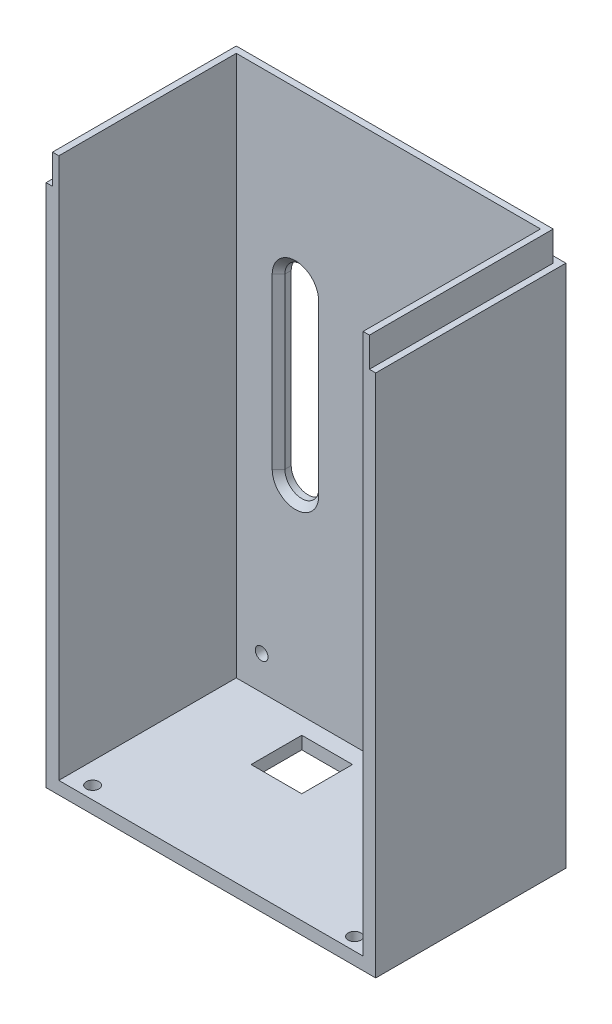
ISO-10303-21;
HEADER;
FILE_DESCRIPTION(('STEP AP214'),'2;1');
FILE_NAME('part.step','',(''),(''),'','','');
FILE_SCHEMA(('AUTOMOTIVE_DESIGN { 1 0 10303 214 1 1 1 1 }'));
ENDSEC;
DATA;
#1=APPLICATION_CONTEXT('core data for automotive mechanical design processes');
#2=APPLICATION_PROTOCOL_DEFINITION('international standard','automotive_design',2000,#1);
#3=PRODUCT_CONTEXT('',#1,'mechanical');
#4=PRODUCT('Part','Part','',(#3));
#5=PRODUCT_RELATED_PRODUCT_CATEGORY('part','',(#4));
#6=PRODUCT_DEFINITION_FORMATION('','',#4);
#7=PRODUCT_DEFINITION_CONTEXT('part definition',#1,'design');
#8=PRODUCT_DEFINITION('design','',#6,#7);
#9=PRODUCT_DEFINITION_SHAPE('','',#8);
#10=(LENGTH_UNIT() NAMED_UNIT(*) SI_UNIT(.MILLI.,.METRE.));
#11=(NAMED_UNIT(*) PLANE_ANGLE_UNIT() SI_UNIT($,.RADIAN.));
#12=(NAMED_UNIT(*) SI_UNIT($,.STERADIAN.) SOLID_ANGLE_UNIT());
#13=UNCERTAINTY_MEASURE_WITH_UNIT(LENGTH_MEASURE(1.E-05),#10,'distance_accuracy_value','');
#14=(GEOMETRIC_REPRESENTATION_CONTEXT(3) GLOBAL_UNCERTAINTY_ASSIGNED_CONTEXT((#13)) GLOBAL_UNIT_ASSIGNED_CONTEXT((#10,
#11,#12)) REPRESENTATION_CONTEXT('',''));
#15=CARTESIAN_POINT('',(0.,0.,0.));
#16=DIRECTION('',(0.,0.,1.));
#17=DIRECTION('',(1.,0.,0.));
#18=AXIS2_PLACEMENT_3D('',#15,#16,#17);
#19=CARTESIAN_POINT('',(39.,128.,3.));
#20=DIRECTION('',(-1.,0.,0.));
#21=DIRECTION('',(0.,-1.,0.));
#22=AXIS2_PLACEMENT_3D('',#19,#20,#21);
#23=PLANE('',#22);
#24=DIRECTION('',(0.,1.,0.));
#25=VECTOR('',#24,1.);
#26=CARTESIAN_POINT('',(39.,128.,0.));
#27=LINE('',#26,#25);
#28=CARTESIAN_POINT('',(39.,-128.,0.));
#29=VERTEX_POINT('',#28);
#30=CARTESIAN_POINT('',(39.,-4.00000000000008,0.));
#31=VERTEX_POINT('',#30);
#32=EDGE_CURVE('E428',#29,#31,#27,.T.);
#33=ORIENTED_EDGE('',*,*,#32,.T.);
#34=DIRECTION('',(0.,0.,-1.));
#35=VECTOR('',#34,1.);
#36=CARTESIAN_POINT('',(39.,-4.00000000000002,45.));
#37=LINE('',#36,#35);
#38=CARTESIAN_POINT('',(39.,-4.00000000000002,45.));
#39=VERTEX_POINT('',#38);
#40=EDGE_CURVE('E299',#39,#31,#37,.T.);
#41=ORIENTED_EDGE('',*,*,#40,.F.);
#42=DIRECTION('',(0.,1.,0.));
#43=VECTOR('',#42,1.);
#44=CARTESIAN_POINT('',(39.,-128.,45.));
#45=LINE('',#44,#43);
#46=CARTESIAN_POINT('',(39.,-128.,45.));
#47=VERTEX_POINT('',#46);
#48=EDGE_CURVE('E425',#47,#39,#45,.T.);
#49=ORIENTED_EDGE('',*,*,#48,.F.);
#50=DIRECTION('',(0.,0.,-1.));
#51=VECTOR('',#50,1.);
#52=CARTESIAN_POINT('',(39.,-128.,3.));
#53=LINE('',#52,#51);
#54=EDGE_CURVE('E435',#47,#29,#53,.T.);
#55=ORIENTED_EDGE('',*,*,#54,.T.);
#56=EDGE_LOOP('',(#33,#41,#49,#55));
#57=FACE_BOUND('',#56,.T.);
#58=ADVANCED_FACE('F41',(#57),#23,.F.);
#59=CARTESIAN_POINT('',(-39.,128.,3.));
#60=DIRECTION('',(1.,0.,0.));
#61=DIRECTION('',(0.,1.,0.));
#62=AXIS2_PLACEMENT_3D('',#59,#60,#61);
#63=PLANE('',#62);
#64=DIRECTION('',(0.,0.,-1.));
#65=VECTOR('',#64,1.);
#66=CARTESIAN_POINT('',(-39.,-4.00000000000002,45.));
#67=LINE('',#66,#65);
#68=CARTESIAN_POINT('',(-39.,-4.00000000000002,45.));
#69=VERTEX_POINT('',#68);
#70=CARTESIAN_POINT('',(-39.,-3.99999999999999,0.));
#71=VERTEX_POINT('',#70);
#72=EDGE_CURVE('E264',#69,#71,#67,.T.);
#73=ORIENTED_EDGE('',*,*,#72,.T.);
#74=DIRECTION('',(0.,-1.,0.));
#75=VECTOR('',#74,1.);
#76=CARTESIAN_POINT('',(-39.,128.,0.));
#77=LINE('',#76,#75);
#78=CARTESIAN_POINT('',(-39.,-128.,0.));
#79=VERTEX_POINT('',#78);
#80=EDGE_CURVE('E431',#71,#79,#77,.T.);
#81=ORIENTED_EDGE('',*,*,#80,.T.);
#82=DIRECTION('',(0.,0.,-1.));
#83=VECTOR('',#82,1.);
#84=CARTESIAN_POINT('',(-39.,-128.,3.));
#85=LINE('',#84,#83);
#86=CARTESIAN_POINT('',(-39.,-128.,45.));
#87=VERTEX_POINT('',#86);
#88=EDGE_CURVE('E438',#87,#79,#85,.T.);
#89=ORIENTED_EDGE('',*,*,#88,.F.);
#90=DIRECTION('',(0.,-1.,0.));
#91=VECTOR('',#90,1.);
#92=CARTESIAN_POINT('',(-39.,128.,45.));
#93=LINE('',#92,#91);
#94=EDGE_CURVE('E420',#69,#87,#93,.T.);
#95=ORIENTED_EDGE('',*,*,#94,.F.);
#96=EDGE_LOOP('',(#73,#81,#89,#95));
#97=FACE_BOUND('',#96,.T.);
#98=ADVANCED_FACE('F568',(#97),#63,.F.);
#99=CARTESIAN_POINT('',(0.,0.,0.));
#100=DIRECTION('',(0.,0.,1.));
#101=DIRECTION('',(1.,0.,0.));
#102=AXIS2_PLACEMENT_3D('',#99,#100,#101);
#103=PLANE('',#102);
#104=CARTESIAN_POINT('',(22.,-78.,0.));
#105=DIRECTION('',(0.,0.,1.));
#106=DIRECTION('',(1.,0.,0.));
#107=AXIS2_PLACEMENT_3D('',#104,#105,#106);
#108=CIRCLE('',#107,5.5);
#109=CARTESIAN_POINT('',(16.5,-78.,0.));
#110=VERTEX_POINT('',#109);
#111=CARTESIAN_POINT('',(27.5,-78.,0.));
#112=VERTEX_POINT('',#111);
#113=EDGE_CURVE('E510',#110,#112,#108,.T.);
#114=ORIENTED_EDGE('',*,*,#113,.T.);
#115=DIRECTION('',(0.,1.,0.));
#116=VECTOR('',#115,1.);
#117=CARTESIAN_POINT('',(27.5,0.,0.));
#118=LINE('',#117,#116);
#119=CARTESIAN_POINT('',(27.5,-38.,0.));
#120=VERTEX_POINT('',#119);
#121=EDGE_CURVE('E512',#112,#120,#118,.T.);
#122=ORIENTED_EDGE('',*,*,#121,.T.);
#123=CARTESIAN_POINT('',(22.,-38.,0.));
#124=DIRECTION('',(0.,0.,1.));
#125=DIRECTION('',(1.,0.,0.));
#126=AXIS2_PLACEMENT_3D('',#123,#124,#125);
#127=CIRCLE('',#126,5.5);
#128=CARTESIAN_POINT('',(16.5,-38.,0.));
#129=VERTEX_POINT('',#128);
#130=EDGE_CURVE('E508',#120,#129,#127,.T.);
#131=ORIENTED_EDGE('',*,*,#130,.T.);
#132=DIRECTION('',(0.,-1.,0.));
#133=VECTOR('',#132,1.);
#134=CARTESIAN_POINT('',(16.5,0.,0.));
#135=LINE('',#134,#133);
#136=EDGE_CURVE('E506',#129,#110,#135,.T.);
#137=ORIENTED_EDGE('',*,*,#136,.T.);
#138=EDGE_LOOP('',(#114,#122,#131,#137));
#139=FACE_BOUND('',#138,.T.);
#140=DIRECTION('',(0.,-1.,0.));
#141=VECTOR('',#140,1.);
#142=CARTESIAN_POINT('',(-18.0000000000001,-38.,0.));
#143=LINE('',#142,#141);
#144=CARTESIAN_POINT('',(-18.0000000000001,-38.,0.));
#145=VERTEX_POINT('',#144);
#146=CARTESIAN_POINT('',(-18.0000000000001,-78.,0.));
#147=VERTEX_POINT('',#146);
#148=EDGE_CURVE('E345',#145,#147,#143,.T.);
#149=ORIENTED_EDGE('',*,*,#148,.F.);
#150=CARTESIAN_POINT('',(-22.0000000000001,-38.,0.));
#151=DIRECTION('',(0.,0.,-1.));
#152=DIRECTION('',(-1.,0.,0.));
#153=AXIS2_PLACEMENT_3D('',#150,#151,#152);
#154=CIRCLE('',#153,4.);
#155=CARTESIAN_POINT('',(-26.0000000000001,-38.,0.));
#156=VERTEX_POINT('',#155);
#157=EDGE_CURVE('E348',#156,#145,#154,.T.);
#158=ORIENTED_EDGE('',*,*,#157,.F.);
#159=DIRECTION('',(0.,1.,0.));
#160=VECTOR('',#159,1.);
#161=CARTESIAN_POINT('',(-26.0000000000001,-38.,0.));
#162=LINE('',#161,#160);
#163=CARTESIAN_POINT('',(-26.0000000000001,-78.,0.));
#164=VERTEX_POINT('',#163);
#165=EDGE_CURVE('E334',#164,#156,#162,.T.);
#166=ORIENTED_EDGE('',*,*,#165,.F.);
#167=CARTESIAN_POINT('',(-22.0000000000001,-78.,0.));
#168=DIRECTION('',(0.,0.,-1.));
#169=DIRECTION('',(-1.,0.,0.));
#170=AXIS2_PLACEMENT_3D('',#167,#168,#169);
#171=CIRCLE('',#170,4.);
#172=EDGE_CURVE('E342',#147,#164,#171,.T.);
#173=ORIENTED_EDGE('',*,*,#172,.F.);
#174=EDGE_LOOP('',(#149,#158,#166,#173));
#175=FACE_BOUND('',#174,.T.);
#176=CARTESIAN_POINT('',(-30.,-117.,0.));
#177=DIRECTION('',(0.,0.,-1.));
#178=DIRECTION('',(-1.,0.,0.));
#179=AXIS2_PLACEMENT_3D('',#176,#177,#178);
#180=CIRCLE('',#179,1.5);
#181=CARTESIAN_POINT('',(-31.5,-117.,0.));
#182=VERTEX_POINT('',#181);
#183=EDGE_CURVE('E315',#182,#182,#180,.T.);
#184=ORIENTED_EDGE('',*,*,#183,.F.);
#185=EDGE_LOOP('',(#184));
#186=FACE_BOUND('',#185,.T.);
#187=CARTESIAN_POINT('',(30.,-117.,0.));
#188=DIRECTION('',(0.,0.,-1.));
#189=DIRECTION('',(-1.,0.,0.));
#190=AXIS2_PLACEMENT_3D('',#187,#188,#189);
#191=CIRCLE('',#190,1.5);
#192=CARTESIAN_POINT('',(28.5,-117.,0.));
#193=VERTEX_POINT('',#192);
#194=EDGE_CURVE('E314',#193,#193,#191,.T.);
#195=ORIENTED_EDGE('',*,*,#194,.F.);
#196=EDGE_LOOP('',(#195));
#197=FACE_BOUND('',#196,.T.);
#198=DIRECTION('',(-1.,0.,0.));
#199=VECTOR('',#198,1.);
#200=CARTESIAN_POINT('',(39.,-4.00000000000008,0.));
#201=LINE('',#200,#199);
#202=EDGE_CURVE('E275',#31,#71,#201,.T.);
#203=ORIENTED_EDGE('',*,*,#202,.F.);
#204=ORIENTED_EDGE('',*,*,#32,.F.);
#205=DIRECTION('',(1.,0.,0.));
#206=VECTOR('',#205,1.);
#207=CARTESIAN_POINT('',(-39.,-128.,0.));
#208=LINE('',#207,#206);
#209=EDGE_CURVE('E433',#79,#29,#208,.T.);
#210=ORIENTED_EDGE('',*,*,#209,.F.);
#211=ORIENTED_EDGE('',*,*,#80,.F.);
#212=EDGE_LOOP('',(#203,#204,#210,#211));
#213=FACE_BOUND('',#212,.T.);
#214=ADVANCED_FACE('F535',(#139,#175,#186,#197,#213),#103,.F.);
#215=CARTESIAN_POINT('',(0.,0.,45.));
#216=DIRECTION('',(0.,0.,1.));
#217=DIRECTION('',(1.,0.,0.));
#218=AXIS2_PLACEMENT_3D('',#215,#216,#217);
#219=PLANE('',#218);
#220=DIRECTION('',(0.,1.,0.));
#221=VECTOR('',#220,1.);
#222=CARTESIAN_POINT('',(-37.5,2.99999999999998,45.));
#223=LINE('',#222,#221);
#224=CARTESIAN_POINT('',(-37.5,-4.00000000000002,45.));
#225=VERTEX_POINT('',#224);
#226=CARTESIAN_POINT('',(-37.5,2.99999999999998,45.));
#227=VERTEX_POINT('',#226);
#228=EDGE_CURVE('E290',#225,#227,#223,.T.);
#229=ORIENTED_EDGE('',*,*,#228,.F.);
#230=DIRECTION('',(1.,0.,0.));
#231=VECTOR('',#230,1.);
#232=CARTESIAN_POINT('',(-37.5,-4.00000000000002,45.));
#233=LINE('',#232,#231);
#234=EDGE_CURVE('E261',#69,#225,#233,.T.);
#235=ORIENTED_EDGE('',*,*,#234,.F.);
#236=ORIENTED_EDGE('',*,*,#94,.T.);
#237=DIRECTION('',(1.,0.,0.));
#238=VECTOR('',#237,1.);
#239=CARTESIAN_POINT('',(-39.,-128.,45.));
#240=LINE('',#239,#238);
#241=EDGE_CURVE('E422',#87,#47,#240,.T.);
#242=ORIENTED_EDGE('',*,*,#241,.T.);
#243=ORIENTED_EDGE('',*,*,#48,.T.);
#244=DIRECTION('',(1.,0.,0.));
#245=VECTOR('',#244,1.);
#246=CARTESIAN_POINT('',(37.5,-4.00000000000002,45.));
#247=LINE('',#246,#245);
#248=CARTESIAN_POINT('',(37.5,-4.00000000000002,45.));
#249=VERTEX_POINT('',#248);
#250=EDGE_CURVE('E301',#249,#39,#247,.T.);
#251=ORIENTED_EDGE('',*,*,#250,.F.);
#252=DIRECTION('',(0.,-1.,0.));
#253=VECTOR('',#252,1.);
#254=CARTESIAN_POINT('',(37.5,2.99999999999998,45.));
#255=LINE('',#254,#253);
#256=CARTESIAN_POINT('',(37.5,2.99999999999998,45.));
#257=VERTEX_POINT('',#256);
#258=EDGE_CURVE('E291',#257,#249,#255,.T.);
#259=ORIENTED_EDGE('',*,*,#258,.F.);
#260=DIRECTION('',(1.,0.,0.));
#261=VECTOR('',#260,1.);
#262=CARTESIAN_POINT('',(36.,2.99999999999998,45.));
#263=LINE('',#262,#261);
#264=CARTESIAN_POINT('',(36.,2.99999999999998,45.));
#265=VERTEX_POINT('',#264);
#266=EDGE_CURVE('E305',#265,#257,#263,.T.);
#267=ORIENTED_EDGE('',*,*,#266,.F.);
#268=DIRECTION('',(0.,1.,0.));
#269=VECTOR('',#268,1.);
#270=CARTESIAN_POINT('',(36.,-125.,45.));
#271=LINE('',#270,#269);
#272=CARTESIAN_POINT('',(36.,-125.,45.));
#273=VERTEX_POINT('',#272);
#274=EDGE_CURVE('E406',#273,#265,#271,.T.);
#275=ORIENTED_EDGE('',*,*,#274,.F.);
#276=DIRECTION('',(1.,0.,0.));
#277=VECTOR('',#276,1.);
#278=CARTESIAN_POINT('',(-36.,-125.,45.));
#279=LINE('',#278,#277);
#280=CARTESIAN_POINT('',(-36.,-125.,45.));
#281=VERTEX_POINT('',#280);
#282=EDGE_CURVE('E402',#281,#273,#279,.T.);
#283=ORIENTED_EDGE('',*,*,#282,.F.);
#284=DIRECTION('',(0.,-1.,0.));
#285=VECTOR('',#284,1.);
#286=CARTESIAN_POINT('',(-36.,125.,45.));
#287=LINE('',#286,#285);
#288=CARTESIAN_POINT('',(-36.,2.99999999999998,45.));
#289=VERTEX_POINT('',#288);
#290=EDGE_CURVE('E400',#289,#281,#287,.T.);
#291=ORIENTED_EDGE('',*,*,#290,.F.);
#292=EDGE_CURVE('E306',#227,#289,#263,.T.);
#293=ORIENTED_EDGE('',*,*,#292,.F.);
#294=EDGE_LOOP('',(#229,#235,#236,#242,#243,#251,#259,#267,#275,#283,#291,#293));
#295=FACE_BOUND('',#294,.T.);
#296=ADVANCED_FACE('F750',(#295),#219,.T.);
#297=CARTESIAN_POINT('',(39.,2.99999999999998,45.));
#298=DIRECTION('',(0.,1.,0.));
#299=DIRECTION('',(-1.,0.,0.));
#300=AXIS2_PLACEMENT_3D('',#297,#298,#299);
#301=PLANE('',#300);
#302=DIRECTION('',(0.,0.,-1.));
#303=VECTOR('',#302,1.);
#304=CARTESIAN_POINT('',(37.5,2.99999999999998,45.));
#305=LINE('',#304,#303);
#306=CARTESIAN_POINT('',(37.5,2.99999999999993,1.5));
#307=VERTEX_POINT('',#306);
#308=EDGE_CURVE('E287',#257,#307,#305,.T.);
#309=ORIENTED_EDGE('',*,*,#308,.T.);
#310=DIRECTION('',(1.,0.,0.));
#311=VECTOR('',#310,1.);
#312=CARTESIAN_POINT('',(-37.5,3.00000000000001,1.5));
#313=LINE('',#312,#311);
#314=CARTESIAN_POINT('',(-37.5,3.00000000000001,1.5));
#315=VERTEX_POINT('',#314);
#316=EDGE_CURVE('E280',#315,#307,#313,.T.);
#317=ORIENTED_EDGE('',*,*,#316,.F.);
#318=DIRECTION('',(0.,0.,-1.));
#319=VECTOR('',#318,1.);
#320=CARTESIAN_POINT('',(-37.5,2.99999999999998,45.));
#321=LINE('',#320,#319);
#322=EDGE_CURVE('E265',#227,#315,#321,.T.);
#323=ORIENTED_EDGE('',*,*,#322,.F.);
#324=ORIENTED_EDGE('',*,*,#292,.T.);
#325=DIRECTION('',(0.,0.,1.));
#326=VECTOR('',#325,1.);
#327=CARTESIAN_POINT('',(-36.,2.99999999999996,45.));
#328=LINE('',#327,#326);
#329=CARTESIAN_POINT('',(-36.,2.99999999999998,3.));
#330=VERTEX_POINT('',#329);
#331=EDGE_CURVE('E311',#330,#289,#328,.T.);
#332=ORIENTED_EDGE('',*,*,#331,.F.);
#333=DIRECTION('',(1.,0.,0.));
#334=VECTOR('',#333,1.);
#335=CARTESIAN_POINT('',(39.,2.99999999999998,3.));
#336=LINE('',#335,#334);
#337=CARTESIAN_POINT('',(36.,2.99999999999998,3.));
#338=VERTEX_POINT('',#337);
#339=EDGE_CURVE('E295',#330,#338,#336,.T.);
#340=ORIENTED_EDGE('',*,*,#339,.T.);
#341=DIRECTION('',(0.,0.,-1.));
#342=VECTOR('',#341,1.);
#343=CARTESIAN_POINT('',(36.,2.99999999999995,45.));
#344=LINE('',#343,#342);
#345=EDGE_CURVE('E308',#265,#338,#344,.T.);
#346=ORIENTED_EDGE('',*,*,#345,.F.);
#347=ORIENTED_EDGE('',*,*,#266,.T.);
#348=EDGE_LOOP('',(#309,#317,#323,#324,#332,#340,#346,#347));
#349=FACE_BOUND('',#348,.T.);
#350=ADVANCED_FACE('F763',(#349),#301,.T.);
#351=CARTESIAN_POINT('',(-36.,125.,45.));
#352=DIRECTION('',(1.,0.,0.));
#353=DIRECTION('',(0.,1.,0.));
#354=AXIS2_PLACEMENT_3D('',#351,#352,#353);
#355=PLANE('',#354);
#356=DIRECTION('',(0.,-1.,0.));
#357=VECTOR('',#356,1.);
#358=CARTESIAN_POINT('',(-36.,125.,3.));
#359=LINE('',#358,#357);
#360=CARTESIAN_POINT('',(-36.,-125.,3.));
#361=VERTEX_POINT('',#360);
#362=EDGE_CURVE('E373',#330,#361,#359,.T.);
#363=ORIENTED_EDGE('',*,*,#362,.F.);
#364=ORIENTED_EDGE('',*,*,#331,.T.);
#365=ORIENTED_EDGE('',*,*,#290,.T.);
#366=DIRECTION('',(0.,0.,-1.));
#367=VECTOR('',#366,1.);
#368=CARTESIAN_POINT('',(-36.,-125.,45.));
#369=LINE('',#368,#367);
#370=EDGE_CURVE('E417',#281,#361,#369,.T.);
#371=ORIENTED_EDGE('',*,*,#370,.T.);
#372=EDGE_LOOP('',(#363,#364,#365,#371));
#373=FACE_BOUND('',#372,.T.);
#374=ADVANCED_FACE('F771',(#373),#355,.T.);
#375=CARTESIAN_POINT('',(36.,-125.,45.));
#376=DIRECTION('',(-1.,0.,0.));
#377=DIRECTION('',(0.,-1.,0.));
#378=AXIS2_PLACEMENT_3D('',#375,#376,#377);
#379=PLANE('',#378);
#380=ORIENTED_EDGE('',*,*,#274,.T.);
#381=ORIENTED_EDGE('',*,*,#345,.T.);
#382=DIRECTION('',(0.,1.,0.));
#383=VECTOR('',#382,1.);
#384=CARTESIAN_POINT('',(36.,-125.,3.));
#385=LINE('',#384,#383);
#386=CARTESIAN_POINT('',(36.,-125.,3.));
#387=VERTEX_POINT('',#386);
#388=EDGE_CURVE('E403',#387,#338,#385,.T.);
#389=ORIENTED_EDGE('',*,*,#388,.F.);
#390=DIRECTION('',(0.,0.,-1.));
#391=VECTOR('',#390,1.);
#392=CARTESIAN_POINT('',(36.,-125.,45.));
#393=LINE('',#392,#391);
#394=EDGE_CURVE('E409',#273,#387,#393,.T.);
#395=ORIENTED_EDGE('',*,*,#394,.F.);
#396=EDGE_LOOP('',(#380,#381,#389,#395));
#397=FACE_BOUND('',#396,.T.);
#398=ADVANCED_FACE('F778',(#397),#379,.T.);
#399=CARTESIAN_POINT('',(-39.,-128.,3.));
#400=DIRECTION('',(0.,1.,0.));
#401=DIRECTION('',(0.,0.,1.));
#402=AXIS2_PLACEMENT_3D('',#399,#400,#401);
#403=PLANE('',#402);
#404=CARTESIAN_POINT('',(-31.,-128.,42.));
#405=DIRECTION('',(0.,-1.,0.));
#406=DIRECTION('',(0.,0.,-1.));
#407=AXIS2_PLACEMENT_3D('',#404,#405,#406);
#408=CIRCLE('',#407,1.5);
#409=CARTESIAN_POINT('',(-31.,-128.,40.5));
#410=VERTEX_POINT('',#409);
#411=EDGE_CURVE('E352',#410,#410,#408,.T.);
#412=ORIENTED_EDGE('',*,*,#411,.F.);
#413=EDGE_LOOP('',(#412));
#414=FACE_BOUND('',#413,.T.);
#415=CARTESIAN_POINT('',(31.,-128.,42.));
#416=DIRECTION('',(0.,-1.,0.));
#417=DIRECTION('',(0.,0.,-1.));
#418=AXIS2_PLACEMENT_3D('',#415,#416,#417);
#419=CIRCLE('',#418,1.5);
#420=CARTESIAN_POINT('',(31.,-128.,40.5));
#421=VERTEX_POINT('',#420);
#422=EDGE_CURVE('E351',#421,#421,#419,.T.);
#423=ORIENTED_EDGE('',*,*,#422,.F.);
#424=EDGE_LOOP('',(#423));
#425=FACE_BOUND('',#424,.T.);
#426=DIRECTION('',(-1.,0.,0.));
#427=VECTOR('',#426,1.);
#428=CARTESIAN_POINT('',(-16.5,-128.,19.));
#429=LINE('',#428,#427);
#430=CARTESIAN_POINT('',(-4.50000000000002,-128.,19.));
#431=VERTEX_POINT('',#430);
#432=CARTESIAN_POINT('',(-16.5,-128.,19.));
#433=VERTEX_POINT('',#432);
#434=EDGE_CURVE('E360',#431,#433,#429,.T.);
#435=ORIENTED_EDGE('',*,*,#434,.F.);
#436=DIRECTION('',(0.,0.,1.));
#437=VECTOR('',#436,1.);
#438=CARTESIAN_POINT('',(-4.50000000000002,-128.,19.));
#439=LINE('',#438,#437);
#440=CARTESIAN_POINT('',(-4.50000000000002,-128.,7.00000000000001));
#441=VERTEX_POINT('',#440);
#442=EDGE_CURVE('E358',#441,#431,#439,.T.);
#443=ORIENTED_EDGE('',*,*,#442,.F.);
#444=DIRECTION('',(1.,0.,0.));
#445=VECTOR('',#444,1.);
#446=CARTESIAN_POINT('',(-16.5,-128.,7.00000000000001));
#447=LINE('',#446,#445);
#448=CARTESIAN_POINT('',(-16.5,-128.,7.00000000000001));
#449=VERTEX_POINT('',#448);
#450=EDGE_CURVE('E367',#449,#441,#447,.T.);
#451=ORIENTED_EDGE('',*,*,#450,.F.);
#452=DIRECTION('',(0.,0.,-1.));
#453=VECTOR('',#452,1.);
#454=CARTESIAN_POINT('',(-16.5,-128.,7.00000000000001));
#455=LINE('',#454,#453);
#456=EDGE_CURVE('E364',#433,#449,#455,.T.);
#457=ORIENTED_EDGE('',*,*,#456,.F.);
#458=EDGE_LOOP('',(#435,#443,#451,#457));
#459=FACE_BOUND('',#458,.T.);
#460=DIRECTION('',(0.,0.,1.));
#461=VECTOR('',#460,1.);
#462=CARTESIAN_POINT('',(24.,-128.,7.00000000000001));
#463=LINE('',#462,#461);
#464=CARTESIAN_POINT('',(24.,-128.,7.00000000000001));
#465=VERTEX_POINT('',#464);
#466=CARTESIAN_POINT('',(24.,-128.,18.));
#467=VERTEX_POINT('',#466);
#468=EDGE_CURVE('E396',#465,#467,#463,.T.);
#469=ORIENTED_EDGE('',*,*,#468,.F.);
#470=DIRECTION('',(1.,0.,0.));
#471=VECTOR('',#470,1.);
#472=CARTESIAN_POINT('',(14.5,-128.,7.00000000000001));
#473=LINE('',#472,#471);
#474=CARTESIAN_POINT('',(14.5,-128.,7.00000000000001));
#475=VERTEX_POINT('',#474);
#476=EDGE_CURVE('E361',#475,#465,#473,.T.);
#477=ORIENTED_EDGE('',*,*,#476,.F.);
#478=DIRECTION('',(0.,0.,-1.));
#479=VECTOR('',#478,1.);
#480=CARTESIAN_POINT('',(14.5,-128.,18.));
#481=LINE('',#480,#479);
#482=CARTESIAN_POINT('',(14.5,-128.,18.));
#483=VERTEX_POINT('',#482);
#484=EDGE_CURVE('E383',#483,#475,#481,.T.);
#485=ORIENTED_EDGE('',*,*,#484,.F.);
#486=DIRECTION('',(-1.,0.,0.));
#487=VECTOR('',#486,1.);
#488=CARTESIAN_POINT('',(24.,-128.,18.));
#489=LINE('',#488,#487);
#490=EDGE_CURVE('E393',#467,#483,#489,.T.);
#491=ORIENTED_EDGE('',*,*,#490,.F.);
#492=EDGE_LOOP('',(#469,#477,#485,#491));
#493=FACE_BOUND('',#492,.T.);
#494=ORIENTED_EDGE('',*,*,#209,.T.);
#495=ORIENTED_EDGE('',*,*,#54,.F.);
#496=ORIENTED_EDGE('',*,*,#241,.F.);
#497=ORIENTED_EDGE('',*,*,#88,.T.);
#498=EDGE_LOOP('',(#494,#495,#496,#497));
#499=FACE_BOUND('',#498,.T.);
#500=ADVANCED_FACE('F785',(#414,#425,#459,#493,#499),#403,.F.);
#501=CARTESIAN_POINT('',(-36.,-125.,45.));
#502=DIRECTION('',(0.,1.,0.));
#503=DIRECTION('',(0.,0.,1.));
#504=AXIS2_PLACEMENT_3D('',#501,#502,#503);
#505=PLANE('',#504);
#506=CARTESIAN_POINT('',(-31.,-125.,42.));
#507=DIRECTION('',(0.,1.,0.));
#508=DIRECTION('',(0.,0.,1.));
#509=AXIS2_PLACEMENT_3D('',#506,#507,#508);
#510=CIRCLE('',#509,1.5);
#511=CARTESIAN_POINT('',(-31.,-125.,43.5));
#512=VERTEX_POINT('',#511);
#513=EDGE_CURVE('E390',#512,#512,#510,.T.);
#514=ORIENTED_EDGE('',*,*,#513,.F.);
#515=EDGE_LOOP('',(#514));
#516=FACE_BOUND('',#515,.T.);
#517=CARTESIAN_POINT('',(31.,-125.,42.));
#518=DIRECTION('',(0.,1.,0.));
#519=DIRECTION('',(0.,0.,1.));
#520=AXIS2_PLACEMENT_3D('',#517,#518,#519);
#521=CIRCLE('',#520,1.5);
#522=CARTESIAN_POINT('',(31.,-125.,43.5));
#523=VERTEX_POINT('',#522);
#524=EDGE_CURVE('E355',#523,#523,#521,.T.);
#525=ORIENTED_EDGE('',*,*,#524,.F.);
#526=EDGE_LOOP('',(#525));
#527=FACE_BOUND('',#526,.T.);
#528=DIRECTION('',(0.,0.,-1.));
#529=VECTOR('',#528,1.);
#530=CARTESIAN_POINT('',(-4.50000000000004,-125.,45.));
#531=LINE('',#530,#529);
#532=CARTESIAN_POINT('',(-4.50000000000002,-125.,19.));
#533=VERTEX_POINT('',#532);
#534=CARTESIAN_POINT('',(-4.50000000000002,-125.,7.00000000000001));
#535=VERTEX_POINT('',#534);
#536=EDGE_CURVE('E457',#533,#535,#531,.T.);
#537=ORIENTED_EDGE('',*,*,#536,.F.);
#538=DIRECTION('',(1.,0.,0.));
#539=VECTOR('',#538,1.);
#540=CARTESIAN_POINT('',(-36.,-125.,19.));
#541=LINE('',#540,#539);
#542=CARTESIAN_POINT('',(-16.5,-125.,19.));
#543=VERTEX_POINT('',#542);
#544=EDGE_CURVE('E450',#543,#533,#541,.T.);
#545=ORIENTED_EDGE('',*,*,#544,.F.);
#546=DIRECTION('',(0.,0.,1.));
#547=VECTOR('',#546,1.);
#548=CARTESIAN_POINT('',(-16.5,-125.,45.));
#549=LINE('',#548,#547);
#550=CARTESIAN_POINT('',(-16.5,-125.,7.00000000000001));
#551=VERTEX_POINT('',#550);
#552=EDGE_CURVE('E452',#551,#543,#549,.T.);
#553=ORIENTED_EDGE('',*,*,#552,.F.);
#554=DIRECTION('',(-1.,0.,0.));
#555=VECTOR('',#554,1.);
#556=CARTESIAN_POINT('',(-36.,-125.,7.00000000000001));
#557=LINE('',#556,#555);
#558=EDGE_CURVE('E455',#535,#551,#557,.T.);
#559=ORIENTED_EDGE('',*,*,#558,.F.);
#560=EDGE_LOOP('',(#537,#545,#553,#559));
#561=FACE_BOUND('',#560,.T.);
#562=DIRECTION('',(-1.,0.,0.));
#563=VECTOR('',#562,1.);
#564=CARTESIAN_POINT('',(-36.,-125.,6.99999999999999));
#565=LINE('',#564,#563);
#566=CARTESIAN_POINT('',(24.,-125.,7.00000000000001));
#567=VERTEX_POINT('',#566);
#568=CARTESIAN_POINT('',(14.5,-125.,7.00000000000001));
#569=VERTEX_POINT('',#568);
#570=EDGE_CURVE('E448',#567,#569,#565,.T.);
#571=ORIENTED_EDGE('',*,*,#570,.F.);
#572=DIRECTION('',(0.,0.,-1.));
#573=VECTOR('',#572,1.);
#574=CARTESIAN_POINT('',(24.,-125.,45.));
#575=LINE('',#574,#573);
#576=CARTESIAN_POINT('',(24.,-125.,18.));
#577=VERTEX_POINT('',#576);
#578=EDGE_CURVE('E441',#577,#567,#575,.T.);
#579=ORIENTED_EDGE('',*,*,#578,.F.);
#580=DIRECTION('',(1.,0.,0.));
#581=VECTOR('',#580,1.);
#582=CARTESIAN_POINT('',(-36.,-125.,18.));
#583=LINE('',#582,#581);
#584=CARTESIAN_POINT('',(14.5,-125.,18.));
#585=VERTEX_POINT('',#584);
#586=EDGE_CURVE('E443',#585,#577,#583,.T.);
#587=ORIENTED_EDGE('',*,*,#586,.F.);
#588=DIRECTION('',(0.,0.,1.));
#589=VECTOR('',#588,1.);
#590=CARTESIAN_POINT('',(14.5,-125.,45.));
#591=LINE('',#590,#589);
#592=EDGE_CURVE('E446',#569,#585,#591,.T.);
#593=ORIENTED_EDGE('',*,*,#592,.F.);
#594=EDGE_LOOP('',(#571,#579,#587,#593));
#595=FACE_BOUND('',#594,.T.);
#596=DIRECTION('',(1.,0.,0.));
#597=VECTOR('',#596,1.);
#598=CARTESIAN_POINT('',(-36.,-125.,3.));
#599=LINE('',#598,#597);
#600=EDGE_CURVE('E411',#361,#387,#599,.T.);
#601=ORIENTED_EDGE('',*,*,#600,.F.);
#602=ORIENTED_EDGE('',*,*,#370,.F.);
#603=ORIENTED_EDGE('',*,*,#282,.T.);
#604=ORIENTED_EDGE('',*,*,#394,.T.);
#605=EDGE_LOOP('',(#601,#602,#603,#604));
#606=FACE_BOUND('',#605,.T.);
#607=ADVANCED_FACE('F793',(#516,#527,#561,#595,#606),#505,.T.);
#608=CARTESIAN_POINT('',(0.,0.,3.));
#609=DIRECTION('',(0.,0.,1.));
#610=DIRECTION('',(1.,0.,0.));
#611=AXIS2_PLACEMENT_3D('',#608,#609,#610);
#612=PLANE('',#611);
#613=CARTESIAN_POINT('',(-22.0000000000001,-78.,3.));
#614=DIRECTION('',(0.,0.,1.));
#615=DIRECTION('',(1.,0.,0.));
#616=AXIS2_PLACEMENT_3D('',#613,#614,#615);
#617=CIRCLE('',#616,5.50000000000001);
#618=CARTESIAN_POINT('',(-16.5,-78.,3.));
#619=VERTEX_POINT('',#618);
#620=CARTESIAN_POINT('',(-27.5000000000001,-78.,3.));
#621=VERTEX_POINT('',#620);
#622=EDGE_CURVE('E483',#619,#621,#617,.F.);
#623=ORIENTED_EDGE('',*,*,#622,.T.);
#624=DIRECTION('',(0.,1.,0.));
#625=VECTOR('',#624,1.);
#626=CARTESIAN_POINT('',(-27.5000000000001,-38.,3.));
#627=LINE('',#626,#625);
#628=CARTESIAN_POINT('',(-27.5000000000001,-38.,3.));
#629=VERTEX_POINT('',#628);
#630=EDGE_CURVE('E485',#621,#629,#627,.T.);
#631=ORIENTED_EDGE('',*,*,#630,.T.);
#632=CARTESIAN_POINT('',(-22.0000000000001,-38.,3.));
#633=DIRECTION('',(0.,0.,1.));
#634=DIRECTION('',(1.,0.,0.));
#635=AXIS2_PLACEMENT_3D('',#632,#633,#634);
#636=CIRCLE('',#635,5.50000000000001);
#637=CARTESIAN_POINT('',(-16.5,-38.,3.));
#638=VERTEX_POINT('',#637);
#639=EDGE_CURVE('E481',#629,#638,#636,.F.);
#640=ORIENTED_EDGE('',*,*,#639,.T.);
#641=DIRECTION('',(0.,-1.,0.));
#642=VECTOR('',#641,1.);
#643=CARTESIAN_POINT('',(-16.5,-78.,3.));
#644=LINE('',#643,#642);
#645=EDGE_CURVE('E479',#638,#619,#644,.T.);
#646=ORIENTED_EDGE('',*,*,#645,.T.);
#647=EDGE_LOOP('',(#623,#631,#640,#646));
#648=FACE_BOUND('',#647,.T.);
#649=ORIENTED_EDGE('',*,*,#339,.F.);
#650=ORIENTED_EDGE('',*,*,#362,.T.);
#651=ORIENTED_EDGE('',*,*,#600,.T.);
#652=ORIENTED_EDGE('',*,*,#388,.T.);
#653=EDGE_LOOP('',(#649,#650,#651,#652));
#654=FACE_BOUND('',#653,.T.);
#655=CARTESIAN_POINT('',(22.,-38.,3.));
#656=DIRECTION('',(0.,0.,1.));
#657=DIRECTION('',(1.,0.,0.));
#658=AXIS2_PLACEMENT_3D('',#655,#656,#657);
#659=CIRCLE('',#658,4.);
#660=CARTESIAN_POINT('',(26.,-38.,3.00000000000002));
#661=VERTEX_POINT('',#660);
#662=CARTESIAN_POINT('',(18.,-38.,3.00000000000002));
#663=VERTEX_POINT('',#662);
#664=EDGE_CURVE('E470',#661,#663,#659,.T.);
#665=ORIENTED_EDGE('',*,*,#664,.F.);
#666=DIRECTION('',(0.,1.,0.));
#667=VECTOR('',#666,1.);
#668=CARTESIAN_POINT('',(26.,0.,3.));
#669=LINE('',#668,#667);
#670=CARTESIAN_POINT('',(26.,-78.,3.));
#671=VERTEX_POINT('',#670);
#672=EDGE_CURVE('E459',#671,#661,#669,.T.);
#673=ORIENTED_EDGE('',*,*,#672,.F.);
#674=CARTESIAN_POINT('',(22.,-78.,3.));
#675=DIRECTION('',(0.,0.,1.));
#676=DIRECTION('',(1.,0.,0.));
#677=AXIS2_PLACEMENT_3D('',#674,#675,#676);
#678=CIRCLE('',#677,4.);
#679=CARTESIAN_POINT('',(18.,-78.,3.00000000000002));
#680=VERTEX_POINT('',#679);
#681=EDGE_CURVE('E465',#680,#671,#678,.T.);
#682=ORIENTED_EDGE('',*,*,#681,.F.);
#683=DIRECTION('',(0.,-1.,0.));
#684=VECTOR('',#683,1.);
#685=CARTESIAN_POINT('',(18.,0.,3.));
#686=LINE('',#685,#684);
#687=EDGE_CURVE('E468',#663,#680,#686,.T.);
#688=ORIENTED_EDGE('',*,*,#687,.F.);
#689=EDGE_LOOP('',(#665,#673,#682,#688));
#690=FACE_BOUND('',#689,.T.);
#691=CARTESIAN_POINT('',(-30.,-117.,3.));
#692=DIRECTION('',(0.,0.,1.));
#693=DIRECTION('',(1.,0.,0.));
#694=AXIS2_PLACEMENT_3D('',#691,#692,#693);
#695=CIRCLE('',#694,1.5);
#696=CARTESIAN_POINT('',(-31.5,-117.,3.));
#697=VERTEX_POINT('',#696);
#698=EDGE_CURVE('E318',#697,#697,#695,.T.);
#699=ORIENTED_EDGE('',*,*,#698,.F.);
#700=EDGE_LOOP('',(#699));
#701=FACE_BOUND('',#700,.T.);
#702=CARTESIAN_POINT('',(30.,-117.,3.));
#703=DIRECTION('',(0.,0.,1.));
#704=DIRECTION('',(1.,0.,0.));
#705=AXIS2_PLACEMENT_3D('',#702,#703,#704);
#706=CIRCLE('',#705,1.5);
#707=CARTESIAN_POINT('',(28.5,-117.,3.));
#708=VERTEX_POINT('',#707);
#709=EDGE_CURVE('E331',#708,#708,#706,.T.);
#710=ORIENTED_EDGE('',*,*,#709,.F.);
#711=EDGE_LOOP('',(#710));
#712=FACE_BOUND('',#711,.T.);
#713=ADVANCED_FACE('F552',(#648,#654,#690,#701,#712),#612,.T.);
#714=CARTESIAN_POINT('',(14.5,-121.,7.00000000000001));
#715=DIRECTION('',(0.,0.,-1.));
#716=DIRECTION('',(-1.,0.,0.));
#717=AXIS2_PLACEMENT_3D('',#714,#715,#716);
#718=PLANE('',#717);
#719=ORIENTED_EDGE('',*,*,#570,.T.);
#720=DIRECTION('',(0.,-1.,0.));
#721=VECTOR('',#720,1.);
#722=CARTESIAN_POINT('',(14.5,-121.,7.00000000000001));
#723=LINE('',#722,#721);
#724=EDGE_CURVE('E388',#569,#475,#723,.T.);
#725=ORIENTED_EDGE('',*,*,#724,.T.);
#726=ORIENTED_EDGE('',*,*,#476,.T.);
#727=DIRECTION('',(0.,-1.,0.));
#728=VECTOR('',#727,1.);
#729=CARTESIAN_POINT('',(24.,-121.,7.00000000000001));
#730=LINE('',#729,#728);
#731=EDGE_CURVE('E380',#567,#465,#730,.T.);
#732=ORIENTED_EDGE('',*,*,#731,.F.);
#733=EDGE_LOOP('',(#719,#725,#726,#732));
#734=FACE_BOUND('',#733,.T.);
#735=ADVANCED_FACE('F809',(#734),#718,.F.);
#736=CARTESIAN_POINT('',(14.5,-121.,18.));
#737=DIRECTION('',(-1.,0.,0.));
#738=DIRECTION('',(0.,0.,1.));
#739=AXIS2_PLACEMENT_3D('',#736,#737,#738);
#740=PLANE('',#739);
#741=ORIENTED_EDGE('',*,*,#592,.T.);
#742=DIRECTION('',(0.,-1.,0.));
#743=VECTOR('',#742,1.);
#744=CARTESIAN_POINT('',(14.5,-121.,18.));
#745=LINE('',#744,#743);
#746=EDGE_CURVE('E386',#585,#483,#745,.T.);
#747=ORIENTED_EDGE('',*,*,#746,.T.);
#748=ORIENTED_EDGE('',*,*,#484,.T.);
#749=ORIENTED_EDGE('',*,*,#724,.F.);
#750=EDGE_LOOP('',(#741,#747,#748,#749));
#751=FACE_BOUND('',#750,.T.);
#752=ADVANCED_FACE('F816',(#751),#740,.F.);
#753=CARTESIAN_POINT('',(24.,-121.,18.));
#754=DIRECTION('',(0.,0.,1.));
#755=DIRECTION('',(1.,0.,0.));
#756=AXIS2_PLACEMENT_3D('',#753,#754,#755);
#757=PLANE('',#756);
#758=ORIENTED_EDGE('',*,*,#586,.T.);
#759=DIRECTION('',(0.,-1.,0.));
#760=VECTOR('',#759,1.);
#761=CARTESIAN_POINT('',(24.,-121.,18.));
#762=LINE('',#761,#760);
#763=EDGE_CURVE('E384',#577,#467,#762,.T.);
#764=ORIENTED_EDGE('',*,*,#763,.T.);
#765=ORIENTED_EDGE('',*,*,#490,.T.);
#766=ORIENTED_EDGE('',*,*,#746,.F.);
#767=EDGE_LOOP('',(#758,#764,#765,#766));
#768=FACE_BOUND('',#767,.T.);
#769=ADVANCED_FACE('F824',(#768),#757,.F.);
#770=CARTESIAN_POINT('',(24.,-121.,7.00000000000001));
#771=DIRECTION('',(1.,0.,0.));
#772=DIRECTION('',(0.,0.,-1.));
#773=AXIS2_PLACEMENT_3D('',#770,#771,#772);
#774=PLANE('',#773);
#775=ORIENTED_EDGE('',*,*,#578,.T.);
#776=ORIENTED_EDGE('',*,*,#731,.T.);
#777=ORIENTED_EDGE('',*,*,#468,.T.);
#778=ORIENTED_EDGE('',*,*,#763,.F.);
#779=EDGE_LOOP('',(#775,#776,#777,#778));
#780=FACE_BOUND('',#779,.T.);
#781=ADVANCED_FACE('F832',(#780),#774,.F.);
#782=CARTESIAN_POINT('',(-4.50000000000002,-121.,19.));
#783=DIRECTION('',(1.,0.,0.));
#784=DIRECTION('',(0.,0.,-1.));
#785=AXIS2_PLACEMENT_3D('',#782,#783,#784);
#786=PLANE('',#785);
#787=ORIENTED_EDGE('',*,*,#536,.T.);
#788=DIRECTION('',(0.,-1.,0.));
#789=VECTOR('',#788,1.);
#790=CARTESIAN_POINT('',(-4.50000000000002,-121.,7.00000000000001));
#791=LINE('',#790,#789);
#792=EDGE_CURVE('E371',#535,#441,#791,.T.);
#793=ORIENTED_EDGE('',*,*,#792,.T.);
#794=ORIENTED_EDGE('',*,*,#442,.T.);
#795=DIRECTION('',(0.,-1.,0.));
#796=VECTOR('',#795,1.);
#797=CARTESIAN_POINT('',(-4.50000000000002,-121.,19.));
#798=LINE('',#797,#796);
#799=EDGE_CURVE('E370',#533,#431,#798,.T.);
#800=ORIENTED_EDGE('',*,*,#799,.F.);
#801=EDGE_LOOP('',(#787,#793,#794,#800));
#802=FACE_BOUND('',#801,.T.);
#803=ADVANCED_FACE('F840',(#802),#786,.F.);
#804=CARTESIAN_POINT('',(-16.5,-121.,7.00000000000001));
#805=DIRECTION('',(0.,0.,-1.));
#806=DIRECTION('',(-1.,0.,0.));
#807=AXIS2_PLACEMENT_3D('',#804,#805,#806);
#808=PLANE('',#807);
#809=ORIENTED_EDGE('',*,*,#558,.T.);
#810=DIRECTION('',(0.,-1.,0.));
#811=VECTOR('',#810,1.);
#812=CARTESIAN_POINT('',(-16.5,-121.,7.00000000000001));
#813=LINE('',#812,#811);
#814=EDGE_CURVE('E374',#551,#449,#813,.T.);
#815=ORIENTED_EDGE('',*,*,#814,.T.);
#816=ORIENTED_EDGE('',*,*,#450,.T.);
#817=ORIENTED_EDGE('',*,*,#792,.F.);
#818=EDGE_LOOP('',(#809,#815,#816,#817));
#819=FACE_BOUND('',#818,.T.);
#820=ADVANCED_FACE('F848',(#819),#808,.F.);
#821=CARTESIAN_POINT('',(-16.5,-121.,7.00000000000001));
#822=DIRECTION('',(-1.,0.,0.));
#823=DIRECTION('',(0.,0.,1.));
#824=AXIS2_PLACEMENT_3D('',#821,#822,#823);
#825=PLANE('',#824);
#826=ORIENTED_EDGE('',*,*,#552,.T.);
#827=DIRECTION('',(0.,-1.,0.));
#828=VECTOR('',#827,1.);
#829=CARTESIAN_POINT('',(-16.5,-121.,19.));
#830=LINE('',#829,#828);
#831=EDGE_CURVE('E376',#543,#433,#830,.T.);
#832=ORIENTED_EDGE('',*,*,#831,.T.);
#833=ORIENTED_EDGE('',*,*,#456,.T.);
#834=ORIENTED_EDGE('',*,*,#814,.F.);
#835=EDGE_LOOP('',(#826,#832,#833,#834));
#836=FACE_BOUND('',#835,.T.);
#837=ADVANCED_FACE('F856',(#836),#825,.F.);
#838=CARTESIAN_POINT('',(-16.5,-121.,19.));
#839=DIRECTION('',(0.,0.,1.));
#840=DIRECTION('',(1.,0.,0.));
#841=AXIS2_PLACEMENT_3D('',#838,#839,#840);
#842=PLANE('',#841);
#843=ORIENTED_EDGE('',*,*,#544,.T.);
#844=ORIENTED_EDGE('',*,*,#799,.T.);
#845=ORIENTED_EDGE('',*,*,#434,.T.);
#846=ORIENTED_EDGE('',*,*,#831,.F.);
#847=EDGE_LOOP('',(#843,#844,#845,#846));
#848=FACE_BOUND('',#847,.T.);
#849=ADVANCED_FACE('F864',(#848),#842,.F.);
#850=CARTESIAN_POINT('',(31.,128.,42.));
#851=DIRECTION('',(0.,-1.,0.));
#852=DIRECTION('',(0.,0.,-1.));
#853=AXIS2_PLACEMENT_3D('',#850,#851,#852);
#854=CYLINDRICAL_SURFACE('',#853,1.5);
#855=ORIENTED_EDGE('',*,*,#524,.T.);
#856=EDGE_LOOP('',(#855));
#857=FACE_BOUND('',#856,.T.);
#858=ORIENTED_EDGE('',*,*,#422,.T.);
#859=EDGE_LOOP('',(#858));
#860=FACE_BOUND('',#859,.T.);
#861=ADVANCED_FACE('F871',(#857,#860),#854,.F.);
#862=CARTESIAN_POINT('',(-31.,128.,42.));
#863=DIRECTION('',(0.,-1.,0.));
#864=DIRECTION('',(0.,0.,-1.));
#865=AXIS2_PLACEMENT_3D('',#862,#863,#864);
#866=CYLINDRICAL_SURFACE('',#865,1.5);
#867=ORIENTED_EDGE('',*,*,#513,.T.);
#868=EDGE_LOOP('',(#867));
#869=FACE_BOUND('',#868,.T.);
#870=ORIENTED_EDGE('',*,*,#411,.T.);
#871=EDGE_LOOP('',(#870));
#872=FACE_BOUND('',#871,.T.);
#873=ADVANCED_FACE('F564',(#869,#872),#866,.F.);
#874=CARTESIAN_POINT('',(22.,-38.,45.));
#875=DIRECTION('',(0.,0.,-1.));
#876=DIRECTION('',(-1.,0.,0.));
#877=AXIS2_PLACEMENT_3D('',#874,#875,#876);
#878=CYLINDRICAL_SURFACE('',#877,4.);
#879=DIRECTION('',(0.,0.,-1.));
#880=VECTOR('',#879,1.);
#881=CARTESIAN_POINT('',(18.,-38.,45.));
#882=LINE('',#881,#880);
#883=CARTESIAN_POINT('',(18.,-38.,1.5));
#884=VERTEX_POINT('',#883);
#885=EDGE_CURVE('E329',#663,#884,#882,.T.);
#886=ORIENTED_EDGE('',*,*,#885,.T.);
#887=CARTESIAN_POINT('',(22.,-38.,1.49999999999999));
#888=DIRECTION('',(0.,0.,1.));
#889=DIRECTION('',(1.,0.,0.));
#890=AXIS2_PLACEMENT_3D('',#887,#888,#889);
#891=CIRCLE('',#890,4.);
#892=CARTESIAN_POINT('',(26.,-38.,1.50000000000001));
#893=VERTEX_POINT('',#892);
#894=EDGE_CURVE('E51',#884,#893,#891,.F.);
#895=ORIENTED_EDGE('',*,*,#894,.T.);
#896=DIRECTION('',(0.,0.,-1.));
#897=VECTOR('',#896,1.);
#898=CARTESIAN_POINT('',(26.,-38.,45.));
#899=LINE('',#898,#897);
#900=EDGE_CURVE('E321',#661,#893,#899,.T.);
#901=ORIENTED_EDGE('',*,*,#900,.F.);
#902=ORIENTED_EDGE('',*,*,#664,.T.);
#903=EDGE_LOOP('',(#886,#895,#901,#902));
#904=FACE_BOUND('',#903,.T.);
#905=ADVANCED_FACE('F555',(#904),#878,.F.);
#906=CARTESIAN_POINT('',(18.,-38.,45.));
#907=DIRECTION('',(-1.,0.,0.));
#908=DIRECTION('',(0.,-1.,0.));
#909=AXIS2_PLACEMENT_3D('',#906,#907,#908);
#910=PLANE('',#909);
#911=DIRECTION('',(0.,0.,-1.));
#912=VECTOR('',#911,1.);
#913=CARTESIAN_POINT('',(18.,-78.,45.));
#914=LINE('',#913,#912);
#915=CARTESIAN_POINT('',(18.,-78.,1.5));
#916=VERTEX_POINT('',#915);
#917=EDGE_CURVE('E327',#680,#916,#914,.T.);
#918=ORIENTED_EDGE('',*,*,#917,.T.);
#919=DIRECTION('',(0.,1.,0.));
#920=VECTOR('',#919,1.);
#921=CARTESIAN_POINT('',(18.,-38.,1.49999999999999));
#922=LINE('',#921,#920);
#923=EDGE_CURVE('E11',#916,#884,#922,.T.);
#924=ORIENTED_EDGE('',*,*,#923,.T.);
#925=ORIENTED_EDGE('',*,*,#885,.F.);
#926=ORIENTED_EDGE('',*,*,#687,.T.);
#927=EDGE_LOOP('',(#918,#924,#925,#926));
#928=FACE_BOUND('',#927,.T.);
#929=ADVANCED_FACE('F556',(#928),#910,.F.);
#930=CARTESIAN_POINT('',(22.,-78.,45.));
#931=DIRECTION('',(0.,0.,-1.));
#932=DIRECTION('',(-1.,0.,0.));
#933=AXIS2_PLACEMENT_3D('',#930,#931,#932);
#934=CYLINDRICAL_SURFACE('',#933,4.);
#935=DIRECTION('',(0.,0.,-1.));
#936=VECTOR('',#935,1.);
#937=CARTESIAN_POINT('',(26.,-78.,45.));
#938=LINE('',#937,#936);
#939=CARTESIAN_POINT('',(26.,-78.,1.50000000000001));
#940=VERTEX_POINT('',#939);
#941=EDGE_CURVE('E325',#671,#940,#938,.T.);
#942=ORIENTED_EDGE('',*,*,#941,.T.);
#943=CARTESIAN_POINT('',(22.,-78.,1.49999999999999));
#944=DIRECTION('',(0.,0.,1.));
#945=DIRECTION('',(1.,0.,0.));
#946=AXIS2_PLACEMENT_3D('',#943,#944,#945);
#947=CIRCLE('',#946,4.);
#948=EDGE_CURVE('E65',#940,#916,#947,.F.);
#949=ORIENTED_EDGE('',*,*,#948,.T.);
#950=ORIENTED_EDGE('',*,*,#917,.F.);
#951=ORIENTED_EDGE('',*,*,#681,.T.);
#952=EDGE_LOOP('',(#942,#949,#950,#951));
#953=FACE_BOUND('',#952,.T.);
#954=ADVANCED_FACE('F546',(#953),#934,.F.);
#955=CARTESIAN_POINT('',(26.,-38.,45.));
#956=DIRECTION('',(1.,0.,0.));
#957=DIRECTION('',(0.,1.,0.));
#958=AXIS2_PLACEMENT_3D('',#955,#956,#957);
#959=PLANE('',#958);
#960=ORIENTED_EDGE('',*,*,#900,.T.);
#961=DIRECTION('',(0.,-1.,0.));
#962=VECTOR('',#961,1.);
#963=CARTESIAN_POINT('',(26.,-38.,1.49999999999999));
#964=LINE('',#963,#962);
#965=EDGE_CURVE('E494',#893,#940,#964,.T.);
#966=ORIENTED_EDGE('',*,*,#965,.T.);
#967=ORIENTED_EDGE('',*,*,#941,.F.);
#968=ORIENTED_EDGE('',*,*,#672,.T.);
#969=EDGE_LOOP('',(#960,#966,#967,#968));
#970=FACE_BOUND('',#969,.T.);
#971=ADVANCED_FACE('F544',(#970),#959,.F.);
#972=CARTESIAN_POINT('',(-22.0000000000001,-38.,45.));
#973=DIRECTION('',(0.,0.,-1.));
#974=DIRECTION('',(-1.,0.,0.));
#975=AXIS2_PLACEMENT_3D('',#972,#973,#974);
#976=CYLINDRICAL_SURFACE('',#975,4.);
#977=DIRECTION('',(0.,0.,-1.));
#978=VECTOR('',#977,1.);
#979=CARTESIAN_POINT('',(-18.0000000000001,-38.,45.));
#980=LINE('',#979,#978);
#981=CARTESIAN_POINT('',(-18.0000000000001,-38.,1.50000000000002));
#982=VERTEX_POINT('',#981);
#983=EDGE_CURVE('E332',#982,#145,#980,.T.);
#984=ORIENTED_EDGE('',*,*,#983,.F.);
#985=CARTESIAN_POINT('',(-22.0000000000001,-38.,1.5));
#986=DIRECTION('',(0.,0.,1.));
#987=DIRECTION('',(1.,0.,0.));
#988=AXIS2_PLACEMENT_3D('',#985,#986,#987);
#989=CIRCLE('',#988,4.);
#990=CARTESIAN_POINT('',(-26.0000000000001,-38.,1.50000000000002));
#991=VERTEX_POINT('',#990);
#992=EDGE_CURVE('E490',#982,#991,#989,.T.);
#993=ORIENTED_EDGE('',*,*,#992,.T.);
#994=DIRECTION('',(0.,0.,-1.));
#995=VECTOR('',#994,1.);
#996=CARTESIAN_POINT('',(-26.0000000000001,-38.,45.));
#997=LINE('',#996,#995);
#998=EDGE_CURVE('E324',#991,#156,#997,.T.);
#999=ORIENTED_EDGE('',*,*,#998,.T.);
#1000=ORIENTED_EDGE('',*,*,#157,.T.);
#1001=EDGE_LOOP('',(#984,#993,#999,#1000));
#1002=FACE_BOUND('',#1001,.T.);
#1003=ADVANCED_FACE('F711',(#1002),#976,.F.);
#1004=CARTESIAN_POINT('',(-26.0000000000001,-38.,45.));
#1005=DIRECTION('',(-1.,0.,0.));
#1006=DIRECTION('',(0.,0.,1.));
#1007=AXIS2_PLACEMENT_3D('',#1004,#1005,#1006);
#1008=PLANE('',#1007);
#1009=ORIENTED_EDGE('',*,*,#998,.F.);
#1010=DIRECTION('',(0.,-1.,0.));
#1011=VECTOR('',#1010,1.);
#1012=CARTESIAN_POINT('',(-26.0000000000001,-78.,1.5));
#1013=LINE('',#1012,#1011);
#1014=CARTESIAN_POINT('',(-26.0000000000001,-78.,1.50000000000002));
#1015=VERTEX_POINT('',#1014);
#1016=EDGE_CURVE('E472',#991,#1015,#1013,.T.);
#1017=ORIENTED_EDGE('',*,*,#1016,.T.);
#1018=DIRECTION('',(0.,0.,-1.));
#1019=VECTOR('',#1018,1.);
#1020=CARTESIAN_POINT('',(-26.0000000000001,-78.,45.));
#1021=LINE('',#1020,#1019);
#1022=EDGE_CURVE('E337',#1015,#164,#1021,.T.);
#1023=ORIENTED_EDGE('',*,*,#1022,.T.);
#1024=ORIENTED_EDGE('',*,*,#165,.T.);
#1025=EDGE_LOOP('',(#1009,#1017,#1023,#1024));
#1026=FACE_BOUND('',#1025,.T.);
#1027=ADVANCED_FACE('F703',(#1026),#1008,.F.);
#1028=CARTESIAN_POINT('',(-22.0000000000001,-78.,45.));
#1029=DIRECTION('',(0.,0.,-1.));
#1030=DIRECTION('',(-1.,0.,0.));
#1031=AXIS2_PLACEMENT_3D('',#1028,#1029,#1030);
#1032=CYLINDRICAL_SURFACE('',#1031,4.);
#1033=ORIENTED_EDGE('',*,*,#1022,.F.);
#1034=CARTESIAN_POINT('',(-22.0000000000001,-78.,1.5));
#1035=DIRECTION('',(0.,0.,1.));
#1036=DIRECTION('',(1.,0.,0.));
#1037=AXIS2_PLACEMENT_3D('',#1034,#1035,#1036);
#1038=CIRCLE('',#1037,4.);
#1039=CARTESIAN_POINT('',(-18.0000000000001,-78.,1.50000000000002));
#1040=VERTEX_POINT('',#1039);
#1041=EDGE_CURVE('E488',#1015,#1040,#1038,.T.);
#1042=ORIENTED_EDGE('',*,*,#1041,.T.);
#1043=DIRECTION('',(0.,0.,-1.));
#1044=VECTOR('',#1043,1.);
#1045=CARTESIAN_POINT('',(-18.0000000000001,-78.,45.));
#1046=LINE('',#1045,#1044);
#1047=EDGE_CURVE('E335',#1040,#147,#1046,.T.);
#1048=ORIENTED_EDGE('',*,*,#1047,.T.);
#1049=ORIENTED_EDGE('',*,*,#172,.T.);
#1050=EDGE_LOOP('',(#1033,#1042,#1048,#1049));
#1051=FACE_BOUND('',#1050,.T.);
#1052=ADVANCED_FACE('F695',(#1051),#1032,.F.);
#1053=CARTESIAN_POINT('',(-18.0000000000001,-38.,45.));
#1054=DIRECTION('',(1.,0.,0.));
#1055=DIRECTION('',(0.,0.,-1.));
#1056=AXIS2_PLACEMENT_3D('',#1053,#1054,#1055);
#1057=PLANE('',#1056);
#1058=ORIENTED_EDGE('',*,*,#1047,.F.);
#1059=DIRECTION('',(0.,1.,0.));
#1060=VECTOR('',#1059,1.);
#1061=CARTESIAN_POINT('',(-18.0000000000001,-38.,1.5));
#1062=LINE('',#1061,#1060);
#1063=EDGE_CURVE('E492',#1040,#982,#1062,.T.);
#1064=ORIENTED_EDGE('',*,*,#1063,.T.);
#1065=ORIENTED_EDGE('',*,*,#983,.T.);
#1066=ORIENTED_EDGE('',*,*,#148,.T.);
#1067=EDGE_LOOP('',(#1058,#1064,#1065,#1066));
#1068=FACE_BOUND('',#1067,.T.);
#1069=ADVANCED_FACE('F687',(#1068),#1057,.F.);
#1070=CARTESIAN_POINT('',(-30.,-117.,45.));
#1071=DIRECTION('',(0.,0.,-1.));
#1072=DIRECTION('',(-1.,0.,0.));
#1073=AXIS2_PLACEMENT_3D('',#1070,#1071,#1072);
#1074=CYLINDRICAL_SURFACE('',#1073,1.5);
#1075=CARTESIAN_POINT('',(-31.5,-117.,3.));
#1076=CARTESIAN_POINT('',(-31.5,-117.,2.96875));
#1077=CARTESIAN_POINT('',(-31.5,-117.,2.9375));
#1078=CARTESIAN_POINT('',(-31.5,-117.,2.875));
#1079=CARTESIAN_POINT('',(-31.5,-117.,2.84375));
#1080=CARTESIAN_POINT('',(-31.5,-117.,2.78125));
#1081=CARTESIAN_POINT('',(-31.5,-117.,2.75));
#1082=CARTESIAN_POINT('',(-31.5,-117.,2.6875));
#1083=CARTESIAN_POINT('',(-31.5,-117.,2.65625));
#1084=CARTESIAN_POINT('',(-31.5,-117.,2.59375));
#1085=CARTESIAN_POINT('',(-31.5,-117.,2.5625));
#1086=CARTESIAN_POINT('',(-31.5,-117.,2.5));
#1087=CARTESIAN_POINT('',(-31.5,-117.,2.46875));
#1088=CARTESIAN_POINT('',(-31.5,-117.,2.40625));
#1089=CARTESIAN_POINT('',(-31.5,-117.,2.375));
#1090=CARTESIAN_POINT('',(-31.5,-117.,2.3125));
#1091=CARTESIAN_POINT('',(-31.5,-117.,2.28125));
#1092=CARTESIAN_POINT('',(-31.5,-117.,2.21875));
#1093=CARTESIAN_POINT('',(-31.5,-117.,2.1875));
#1094=CARTESIAN_POINT('',(-31.5,-117.,2.125));
#1095=CARTESIAN_POINT('',(-31.5,-117.,2.09375));
#1096=CARTESIAN_POINT('',(-31.5,-117.,2.03125));
#1097=CARTESIAN_POINT('',(-31.5,-117.,2.));
#1098=CARTESIAN_POINT('',(-31.5,-117.,1.9375));
#1099=CARTESIAN_POINT('',(-31.5,-117.,1.90625));
#1100=CARTESIAN_POINT('',(-31.5,-117.,1.84375));
#1101=CARTESIAN_POINT('',(-31.5,-117.,1.8125));
#1102=CARTESIAN_POINT('',(-31.5,-117.,1.75));
#1103=CARTESIAN_POINT('',(-31.5,-117.,1.71875));
#1104=CARTESIAN_POINT('',(-31.5,-117.,1.65625));
#1105=CARTESIAN_POINT('',(-31.5,-117.,1.625));
#1106=CARTESIAN_POINT('',(-31.5,-117.,1.5625));
#1107=CARTESIAN_POINT('',(-31.5,-117.,1.53125));
#1108=CARTESIAN_POINT('',(-31.5,-117.,1.46875));
#1109=CARTESIAN_POINT('',(-31.5,-117.,1.4375));
#1110=CARTESIAN_POINT('',(-31.5,-117.,1.375));
#1111=CARTESIAN_POINT('',(-31.5,-117.,1.34375));
#1112=CARTESIAN_POINT('',(-31.5,-117.,1.28125));
#1113=CARTESIAN_POINT('',(-31.5,-117.,1.25));
#1114=CARTESIAN_POINT('',(-31.5,-117.,1.1875));
#1115=CARTESIAN_POINT('',(-31.5,-117.,1.15625));
#1116=CARTESIAN_POINT('',(-31.5,-117.,1.09375));
#1117=CARTESIAN_POINT('',(-31.5,-117.,1.0625));
#1118=CARTESIAN_POINT('',(-31.5,-117.,0.999999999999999));
#1119=CARTESIAN_POINT('',(-31.5,-117.,0.96875));
#1120=CARTESIAN_POINT('',(-31.5,-117.,0.906250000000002));
#1121=CARTESIAN_POINT('',(-31.5,-117.,0.875000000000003));
#1122=CARTESIAN_POINT('',(-31.5,-117.,0.812500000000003));
#1123=CARTESIAN_POINT('',(-31.5,-117.,0.781250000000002));
#1124=CARTESIAN_POINT('',(-31.5,-117.,0.718749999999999));
#1125=CARTESIAN_POINT('',(-31.5,-117.,0.687499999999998));
#1126=CARTESIAN_POINT('',(-31.5,-117.,0.624999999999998));
#1127=CARTESIAN_POINT('',(-31.5,-117.,0.593749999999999));
#1128=CARTESIAN_POINT('',(-31.5,-117.,0.531250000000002));
#1129=CARTESIAN_POINT('',(-31.5,-117.,0.500000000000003));
#1130=CARTESIAN_POINT('',(-31.5,-117.,0.437500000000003));
#1131=CARTESIAN_POINT('',(-31.5,-117.,0.406250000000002));
#1132=CARTESIAN_POINT('',(-31.5,-117.,0.343749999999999));
#1133=CARTESIAN_POINT('',(-31.5,-117.,0.312499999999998));
#1134=CARTESIAN_POINT('',(-31.5,-117.,0.249999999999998));
#1135=CARTESIAN_POINT('',(-31.5,-117.,0.218749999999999));
#1136=CARTESIAN_POINT('',(-31.5,-117.,0.156250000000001));
#1137=CARTESIAN_POINT('',(-31.5,-117.,0.125000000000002));
#1138=CARTESIAN_POINT('',(-31.5,-117.,0.0625000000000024));
#1139=CARTESIAN_POINT('',(-31.5,-117.,0.0312500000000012));
#1140=CARTESIAN_POINT('',(-31.5,-117.,0.));
#1141=B_SPLINE_CURVE_WITH_KNOTS('',3,(#1075,#1076,#1077,#1078,#1079,#1080,#1081,#1082,#1083,
#1084,#1085,#1086,#1087,#1088,#1089,#1090,#1091,#1092,#1093,#1094,#1095,#1096,#1097,#1098,#1099,
#1100,#1101,#1102,#1103,#1104,#1105,#1106,#1107,#1108,#1109,#1110,#1111,#1112,#1113,#1114,#1115,
#1116,#1117,#1118,#1119,#1120,#1121,#1122,#1123,#1124,#1125,#1126,#1127,#1128,#1129,#1130,#1131,
#1132,#1133,#1134,#1135,#1136,#1137,#1138,#1139,#1140),.UNSPECIFIED.,.F.,.F.,(4,2,2,2,2,2,2,2,2,
2,2,2,2,2,2,2,2,2,2,2,2,2,2,2,2,2,2,2,2,2,2,2,4),(0.,0.0937500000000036,0.1875,
0.281249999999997,0.375,0.468750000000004,0.5625,0.656249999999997,0.750000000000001,
0.843750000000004,0.937500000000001,1.03125,1.125,1.21875,1.3125,1.40625,1.5,1.59375,1.6875,
1.78125,1.875,1.96875000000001,2.0625,2.15625,2.25,2.34375000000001,2.4375,2.53125,2.625,
2.71875000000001,2.8125,2.90625,3.),.UNSPECIFIED.);
#1142=EDGE_CURVE('BSEAM678',#697,#182,#1141,.T.);
#1143=ORIENTED_EDGE('',*,*,#698,.T.);
#1144=ORIENTED_EDGE('',*,*,#183,.T.);
#1145=ORIENTED_EDGE('',*,*,#1142,.T.);
#1146=ORIENTED_EDGE('',*,*,#1142,.F.);
#1147=EDGE_LOOP('',(#1143,#1145,#1144,#1146));
#1148=FACE_BOUND('',#1147,.T.);
#1149=ADVANCED_FACE('F678',(#1148),#1074,.F.);
#1150=CARTESIAN_POINT('',(30.,-117.,45.));
#1151=DIRECTION('',(0.,0.,-1.));
#1152=DIRECTION('',(-1.,0.,0.));
#1153=AXIS2_PLACEMENT_3D('',#1150,#1151,#1152);
#1154=CYLINDRICAL_SURFACE('',#1153,1.5);
#1155=CARTESIAN_POINT('',(28.5,-117.,3.));
#1156=CARTESIAN_POINT('',(28.5,-117.,2.96875));
#1157=CARTESIAN_POINT('',(28.5,-117.,2.9375));
#1158=CARTESIAN_POINT('',(28.5,-117.,2.875));
#1159=CARTESIAN_POINT('',(28.5,-117.,2.84375));
#1160=CARTESIAN_POINT('',(28.5,-117.,2.78125));
#1161=CARTESIAN_POINT('',(28.5,-117.,2.75));
#1162=CARTESIAN_POINT('',(28.5,-117.,2.6875));
#1163=CARTESIAN_POINT('',(28.5,-117.,2.65625));
#1164=CARTESIAN_POINT('',(28.5,-117.,2.59375));
#1165=CARTESIAN_POINT('',(28.5,-117.,2.5625));
#1166=CARTESIAN_POINT('',(28.5,-117.,2.5));
#1167=CARTESIAN_POINT('',(28.5,-117.,2.46875));
#1168=CARTESIAN_POINT('',(28.5,-117.,2.40625));
#1169=CARTESIAN_POINT('',(28.5,-117.,2.375));
#1170=CARTESIAN_POINT('',(28.5,-117.,2.3125));
#1171=CARTESIAN_POINT('',(28.5,-117.,2.28125));
#1172=CARTESIAN_POINT('',(28.5,-117.,2.21875));
#1173=CARTESIAN_POINT('',(28.5,-117.,2.1875));
#1174=CARTESIAN_POINT('',(28.5,-117.,2.125));
#1175=CARTESIAN_POINT('',(28.5,-117.,2.09375));
#1176=CARTESIAN_POINT('',(28.5,-117.,2.03125));
#1177=CARTESIAN_POINT('',(28.5,-117.,2.));
#1178=CARTESIAN_POINT('',(28.5,-117.,1.9375));
#1179=CARTESIAN_POINT('',(28.5,-117.,1.90625));
#1180=CARTESIAN_POINT('',(28.5,-117.,1.84375));
#1181=CARTESIAN_POINT('',(28.5,-117.,1.8125));
#1182=CARTESIAN_POINT('',(28.5,-117.,1.75));
#1183=CARTESIAN_POINT('',(28.5,-117.,1.71875));
#1184=CARTESIAN_POINT('',(28.5,-117.,1.65625));
#1185=CARTESIAN_POINT('',(28.5,-117.,1.625));
#1186=CARTESIAN_POINT('',(28.5,-117.,1.5625));
#1187=CARTESIAN_POINT('',(28.5,-117.,1.53125));
#1188=CARTESIAN_POINT('',(28.5,-117.,1.46875));
#1189=CARTESIAN_POINT('',(28.5,-117.,1.4375));
#1190=CARTESIAN_POINT('',(28.5,-117.,1.375));
#1191=CARTESIAN_POINT('',(28.5,-117.,1.34375));
#1192=CARTESIAN_POINT('',(28.5,-117.,1.28125));
#1193=CARTESIAN_POINT('',(28.5,-117.,1.25));
#1194=CARTESIAN_POINT('',(28.5,-117.,1.1875));
#1195=CARTESIAN_POINT('',(28.5,-117.,1.15625));
#1196=CARTESIAN_POINT('',(28.5,-117.,1.09375));
#1197=CARTESIAN_POINT('',(28.5,-117.,1.0625));
#1198=CARTESIAN_POINT('',(28.5,-117.,0.999999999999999));
#1199=CARTESIAN_POINT('',(28.5,-117.,0.96875));
#1200=CARTESIAN_POINT('',(28.5,-117.,0.906250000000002));
#1201=CARTESIAN_POINT('',(28.5,-117.,0.875000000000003));
#1202=CARTESIAN_POINT('',(28.5,-117.,0.812500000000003));
#1203=CARTESIAN_POINT('',(28.5,-117.,0.781250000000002));
#1204=CARTESIAN_POINT('',(28.5,-117.,0.718749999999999));
#1205=CARTESIAN_POINT('',(28.5,-117.,0.687499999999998));
#1206=CARTESIAN_POINT('',(28.5,-117.,0.624999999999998));
#1207=CARTESIAN_POINT('',(28.5,-117.,0.593749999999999));
#1208=CARTESIAN_POINT('',(28.5,-117.,0.531250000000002));
#1209=CARTESIAN_POINT('',(28.5,-117.,0.500000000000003));
#1210=CARTESIAN_POINT('',(28.5,-117.,0.437500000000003));
#1211=CARTESIAN_POINT('',(28.5,-117.,0.406250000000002));
#1212=CARTESIAN_POINT('',(28.5,-117.,0.343749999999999));
#1213=CARTESIAN_POINT('',(28.5,-117.,0.312499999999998));
#1214=CARTESIAN_POINT('',(28.5,-117.,0.249999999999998));
#1215=CARTESIAN_POINT('',(28.5,-117.,0.218749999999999));
#1216=CARTESIAN_POINT('',(28.5,-117.,0.156250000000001));
#1217=CARTESIAN_POINT('',(28.5,-117.,0.125000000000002));
#1218=CARTESIAN_POINT('',(28.5,-117.,0.0625000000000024));
#1219=CARTESIAN_POINT('',(28.5,-117.,0.0312500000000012));
#1220=CARTESIAN_POINT('',(28.5,-117.,0.));
#1221=B_SPLINE_CURVE_WITH_KNOTS('',3,(#1155,#1156,#1157,#1158,#1159,#1160,#1161,#1162,#1163,
#1164,#1165,#1166,#1167,#1168,#1169,#1170,#1171,#1172,#1173,#1174,#1175,#1176,#1177,#1178,#1179,
#1180,#1181,#1182,#1183,#1184,#1185,#1186,#1187,#1188,#1189,#1190,#1191,#1192,#1193,#1194,#1195,
#1196,#1197,#1198,#1199,#1200,#1201,#1202,#1203,#1204,#1205,#1206,#1207,#1208,#1209,#1210,#1211,
#1212,#1213,#1214,#1215,#1216,#1217,#1218,#1219,#1220),.UNSPECIFIED.,.F.,.F.,(4,2,2,2,2,2,2,2,2,
2,2,2,2,2,2,2,2,2,2,2,2,2,2,2,2,2,2,2,2,2,2,2,4),(0.,0.0937500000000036,0.1875,
0.281249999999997,0.375,0.468750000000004,0.5625,0.656249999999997,0.750000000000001,
0.843750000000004,0.937500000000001,1.03125,1.125,1.21875,1.3125,1.40625,1.5,1.59375,1.6875,
1.78125,1.875,1.96875000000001,2.0625,2.15625,2.25,2.34375000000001,2.4375,2.53125,2.625,
2.71875000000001,2.8125,2.90625,3.),.UNSPECIFIED.);
#1222=EDGE_CURVE('BSEAM669',#708,#193,#1221,.T.);
#1223=ORIENTED_EDGE('',*,*,#709,.T.);
#1224=ORIENTED_EDGE('',*,*,#194,.T.);
#1225=ORIENTED_EDGE('',*,*,#1222,.T.);
#1226=ORIENTED_EDGE('',*,*,#1222,.F.);
#1227=EDGE_LOOP('',(#1223,#1225,#1224,#1226));
#1228=FACE_BOUND('',#1227,.T.);
#1229=ADVANCED_FACE('F669',(#1228),#1154,.F.);
#1230=CARTESIAN_POINT('',(37.5,2.99999999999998,45.));
#1231=DIRECTION('',(1.,0.,0.));
#1232=DIRECTION('',(0.,0.,-1.));
#1233=AXIS2_PLACEMENT_3D('',#1230,#1231,#1232);
#1234=PLANE('',#1233);
#1235=DIRECTION('',(0.,0.,-1.));
#1236=VECTOR('',#1235,1.);
#1237=CARTESIAN_POINT('',(37.5,-4.00000000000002,45.));
#1238=LINE('',#1237,#1236);
#1239=CARTESIAN_POINT('',(37.5,-4.00000000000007,1.5));
#1240=VERTEX_POINT('',#1239);
#1241=EDGE_CURVE('E297',#249,#1240,#1238,.T.);
#1242=ORIENTED_EDGE('',*,*,#1241,.T.);
#1243=DIRECTION('',(0.,1.,0.));
#1244=VECTOR('',#1243,1.);
#1245=CARTESIAN_POINT('',(37.5,-4.00000000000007,1.5));
#1246=LINE('',#1245,#1244);
#1247=EDGE_CURVE('E274',#1240,#307,#1246,.T.);
#1248=ORIENTED_EDGE('',*,*,#1247,.T.);
#1249=ORIENTED_EDGE('',*,*,#308,.F.);
#1250=ORIENTED_EDGE('',*,*,#258,.T.);
#1251=EDGE_LOOP('',(#1242,#1248,#1249,#1250));
#1252=FACE_BOUND('',#1251,.T.);
#1253=ADVANCED_FACE('F662',(#1252),#1234,.T.);
#1254=CARTESIAN_POINT('',(-37.5,-4.00000000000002,45.));
#1255=DIRECTION('',(0.,1.,0.));
#1256=DIRECTION('',(0.,0.,1.));
#1257=AXIS2_PLACEMENT_3D('',#1254,#1255,#1256);
#1258=PLANE('',#1257);
#1259=DIRECTION('',(0.,0.,-1.));
#1260=VECTOR('',#1259,1.);
#1261=CARTESIAN_POINT('',(-37.5,-4.00000000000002,45.));
#1262=LINE('',#1261,#1260);
#1263=CARTESIAN_POINT('',(-37.5,-3.99999999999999,1.5));
#1264=VERTEX_POINT('',#1263);
#1265=EDGE_CURVE('E254',#225,#1264,#1262,.T.);
#1266=ORIENTED_EDGE('',*,*,#1265,.T.);
#1267=DIRECTION('',(1.,0.,0.));
#1268=VECTOR('',#1267,1.);
#1269=CARTESIAN_POINT('',(-37.5,-3.99999999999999,1.5));
#1270=LINE('',#1269,#1268);
#1271=EDGE_CURVE('E259',#1264,#1240,#1270,.T.);
#1272=ORIENTED_EDGE('',*,*,#1271,.T.);
#1273=ORIENTED_EDGE('',*,*,#1241,.F.);
#1274=ORIENTED_EDGE('',*,*,#250,.T.);
#1275=ORIENTED_EDGE('',*,*,#40,.T.);
#1276=ORIENTED_EDGE('',*,*,#202,.T.);
#1277=ORIENTED_EDGE('',*,*,#72,.F.);
#1278=ORIENTED_EDGE('',*,*,#234,.T.);
#1279=EDGE_LOOP('',(#1266,#1272,#1273,#1274,#1275,#1276,#1277,#1278));
#1280=FACE_BOUND('',#1279,.T.);
#1281=ADVANCED_FACE('F256',(#1280),#1258,.T.);
#1282=CARTESIAN_POINT('',(-37.5,2.99999999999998,45.));
#1283=DIRECTION('',(-1.,0.,0.));
#1284=DIRECTION('',(0.,0.,1.));
#1285=AXIS2_PLACEMENT_3D('',#1282,#1283,#1284);
#1286=PLANE('',#1285);
#1287=ORIENTED_EDGE('',*,*,#322,.T.);
#1288=DIRECTION('',(0.,1.,0.));
#1289=VECTOR('',#1288,1.);
#1290=CARTESIAN_POINT('',(-37.5,-3.99999999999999,1.5));
#1291=LINE('',#1290,#1289);
#1292=EDGE_CURVE('E268',#1264,#315,#1291,.T.);
#1293=ORIENTED_EDGE('',*,*,#1292,.F.);
#1294=ORIENTED_EDGE('',*,*,#1265,.F.);
#1295=ORIENTED_EDGE('',*,*,#228,.T.);
#1296=EDGE_LOOP('',(#1287,#1293,#1294,#1295));
#1297=FACE_BOUND('',#1296,.T.);
#1298=ADVANCED_FACE('F269',(#1297),#1286,.T.);
#1299=CARTESIAN_POINT('',(-37.5,-3.99999999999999,1.5));
#1300=DIRECTION('',(0.,0.,1.));
#1301=DIRECTION('',(1.,0.,0.));
#1302=AXIS2_PLACEMENT_3D('',#1299,#1300,#1301);
#1303=PLANE('',#1302);
#1304=ORIENTED_EDGE('',*,*,#316,.T.);
#1305=ORIENTED_EDGE('',*,*,#1247,.F.);
#1306=ORIENTED_EDGE('',*,*,#1271,.F.);
#1307=ORIENTED_EDGE('',*,*,#1292,.T.);
#1308=EDGE_LOOP('',(#1304,#1305,#1306,#1307));
#1309=FACE_BOUND('',#1308,.T.);
#1310=ADVANCED_FACE('F278',(#1309),#1303,.F.);
#1311=CARTESIAN_POINT('',(-18.0000000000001,-38.,1.5));
#1312=DIRECTION('',(-0.707106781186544,0.,0.707106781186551));
#1313=DIRECTION('',(0.,-1.,0.));
#1314=AXIS2_PLACEMENT_3D('',#1311,#1312,#1313);
#1315=PLANE('',#1314);
#1316=DIRECTION('',(-0.707106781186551,0.,-0.707106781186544));
#1317=VECTOR('',#1316,1.);
#1318=CARTESIAN_POINT('',(-16.5,-78.,3.));
#1319=LINE('',#1318,#1317);
#1320=EDGE_CURVE('E499',#619,#1040,#1319,.T.);
#1321=ORIENTED_EDGE('',*,*,#1320,.F.);
#1322=ORIENTED_EDGE('',*,*,#645,.F.);
#1323=DIRECTION('',(0.707106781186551,0.,0.707106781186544));
#1324=VECTOR('',#1323,1.);
#1325=CARTESIAN_POINT('',(-18.0000000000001,-38.,1.5));
#1326=LINE('',#1325,#1324);
#1327=EDGE_CURVE('E284',#982,#638,#1326,.T.);
#1328=ORIENTED_EDGE('',*,*,#1327,.F.);
#1329=ORIENTED_EDGE('',*,*,#1063,.F.);
#1330=EDGE_LOOP('',(#1321,#1322,#1328,#1329));
#1331=FACE_BOUND('',#1330,.T.);
#1332=ADVANCED_FACE('F599',(#1331),#1315,.T.);
#1333=CARTESIAN_POINT('',(-22.0000000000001,-38.,1.5));
#1334=DIRECTION('',(0.,0.,1.));
#1335=DIRECTION('',(1.,0.,0.));
#1336=AXIS2_PLACEMENT_3D('',#1333,#1334,#1335);
#1337=CONICAL_SURFACE('',#1336,4.,0.785398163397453);
#1338=ORIENTED_EDGE('',*,*,#1327,.T.);
#1339=ORIENTED_EDGE('',*,*,#639,.F.);
#1340=DIRECTION('',(-0.707106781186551,0.,0.707106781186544));
#1341=VECTOR('',#1340,1.);
#1342=CARTESIAN_POINT('',(-26.0000000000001,-38.,1.5));
#1343=LINE('',#1342,#1341);
#1344=EDGE_CURVE('E497',#991,#629,#1343,.T.);
#1345=ORIENTED_EDGE('',*,*,#1344,.F.);
#1346=ORIENTED_EDGE('',*,*,#992,.F.);
#1347=EDGE_LOOP('',(#1338,#1339,#1345,#1346));
#1348=FACE_BOUND('',#1347,.T.);
#1349=ADVANCED_FACE('F592',(#1348),#1337,.F.);
#1350=CARTESIAN_POINT('',(-22.0000000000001,-78.,1.5));
#1351=DIRECTION('',(0.,0.,1.));
#1352=DIRECTION('',(1.,0.,0.));
#1353=AXIS2_PLACEMENT_3D('',#1350,#1351,#1352);
#1354=CONICAL_SURFACE('',#1353,4.,0.785398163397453);
#1355=ORIENTED_EDGE('',*,*,#1320,.T.);
#1356=ORIENTED_EDGE('',*,*,#1041,.F.);
#1357=DIRECTION('',(0.707106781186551,0.,-0.707106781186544));
#1358=VECTOR('',#1357,1.);
#1359=CARTESIAN_POINT('',(-27.5000000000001,-78.,3.));
#1360=LINE('',#1359,#1358);
#1361=EDGE_CURVE('E495',#621,#1015,#1360,.T.);
#1362=ORIENTED_EDGE('',*,*,#1361,.F.);
#1363=ORIENTED_EDGE('',*,*,#622,.F.);
#1364=EDGE_LOOP('',(#1355,#1356,#1362,#1363));
#1365=FACE_BOUND('',#1364,.T.);
#1366=ADVANCED_FACE('F585',(#1365),#1354,.F.);
#1367=CARTESIAN_POINT('',(-26.0000000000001,-38.,1.5));
#1368=DIRECTION('',(0.707106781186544,0.,0.707106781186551));
#1369=DIRECTION('',(0.,1.,0.));
#1370=AXIS2_PLACEMENT_3D('',#1367,#1368,#1369);
#1371=PLANE('',#1370);
#1372=ORIENTED_EDGE('',*,*,#1344,.T.);
#1373=ORIENTED_EDGE('',*,*,#630,.F.);
#1374=ORIENTED_EDGE('',*,*,#1361,.T.);
#1375=ORIENTED_EDGE('',*,*,#1016,.F.);
#1376=EDGE_LOOP('',(#1372,#1373,#1374,#1375));
#1377=FACE_BOUND('',#1376,.T.);
#1378=ADVANCED_FACE('F579',(#1377),#1371,.T.);
#1379=CARTESIAN_POINT('',(18.,-38.,1.49999999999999));
#1380=DIRECTION('',(-0.707106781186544,0.,0.707106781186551));
#1381=DIRECTION('',(0.,1.,0.));
#1382=AXIS2_PLACEMENT_3D('',#1379,#1380,#1381);
#1383=PLANE('',#1382);
#1384=DIRECTION('',(0.707106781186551,0.,0.707106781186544));
#1385=VECTOR('',#1384,1.);
#1386=CARTESIAN_POINT('',(16.5,-78.,0.));
#1387=LINE('',#1386,#1385);
#1388=EDGE_CURVE('E520',#110,#916,#1387,.T.);
#1389=ORIENTED_EDGE('',*,*,#1388,.F.);
#1390=ORIENTED_EDGE('',*,*,#136,.F.);
#1391=DIRECTION('',(-0.707106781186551,0.,-0.707106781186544));
#1392=VECTOR('',#1391,1.);
#1393=CARTESIAN_POINT('',(18.,-38.,1.49999999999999));
#1394=LINE('',#1393,#1392);
#1395=EDGE_CURVE('E46',#884,#129,#1394,.T.);
#1396=ORIENTED_EDGE('',*,*,#1395,.F.);
#1397=ORIENTED_EDGE('',*,*,#923,.F.);
#1398=EDGE_LOOP('',(#1389,#1390,#1396,#1397));
#1399=FACE_BOUND('',#1398,.T.);
#1400=ADVANCED_FACE('F44',(#1399),#1383,.F.);
#1401=CARTESIAN_POINT('',(22.,-38.,1.49999999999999));
#1402=DIRECTION('',(0.,0.,-1.));
#1403=DIRECTION('',(-1.,0.,0.));
#1404=AXIS2_PLACEMENT_3D('',#1401,#1402,#1403);
#1405=CONICAL_SURFACE('',#1404,4.,0.785398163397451);
#1406=ORIENTED_EDGE('',*,*,#1395,.T.);
#1407=ORIENTED_EDGE('',*,*,#130,.F.);
#1408=DIRECTION('',(0.707106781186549,0.,-0.707106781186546));
#1409=VECTOR('',#1408,1.);
#1410=CARTESIAN_POINT('',(26.,-38.,1.49999999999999));
#1411=LINE('',#1410,#1409);
#1412=EDGE_CURVE('E519',#893,#120,#1411,.T.);
#1413=ORIENTED_EDGE('',*,*,#1412,.F.);
#1414=ORIENTED_EDGE('',*,*,#894,.F.);
#1415=EDGE_LOOP('',(#1406,#1407,#1413,#1414));
#1416=FACE_BOUND('',#1415,.T.);
#1417=ADVANCED_FACE('F530',(#1416),#1405,.F.);
#1418=CARTESIAN_POINT('',(22.,-78.,1.49999999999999));
#1419=DIRECTION('',(0.,0.,-1.));
#1420=DIRECTION('',(-1.,0.,0.));
#1421=AXIS2_PLACEMENT_3D('',#1418,#1419,#1420);
#1422=CONICAL_SURFACE('',#1421,4.,0.785398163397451);
#1423=ORIENTED_EDGE('',*,*,#1388,.T.);
#1424=ORIENTED_EDGE('',*,*,#948,.F.);
#1425=DIRECTION('',(-0.707106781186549,0.,0.707106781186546));
#1426=VECTOR('',#1425,1.);
#1427=CARTESIAN_POINT('',(27.5,-78.,0.));
#1428=LINE('',#1427,#1426);
#1429=EDGE_CURVE('E517',#112,#940,#1428,.T.);
#1430=ORIENTED_EDGE('',*,*,#1429,.F.);
#1431=ORIENTED_EDGE('',*,*,#113,.F.);
#1432=EDGE_LOOP('',(#1423,#1424,#1430,#1431));
#1433=FACE_BOUND('',#1432,.T.);
#1434=ADVANCED_FACE('F542',(#1433),#1422,.F.);
#1435=CARTESIAN_POINT('',(26.,-38.,1.49999999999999));
#1436=DIRECTION('',(0.707106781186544,0.,0.707106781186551));
#1437=DIRECTION('',(0.,-1.,0.));
#1438=AXIS2_PLACEMENT_3D('',#1435,#1436,#1437);
#1439=PLANE('',#1438);
#1440=ORIENTED_EDGE('',*,*,#1412,.T.);
#1441=ORIENTED_EDGE('',*,*,#121,.F.);
#1442=ORIENTED_EDGE('',*,*,#1429,.T.);
#1443=ORIENTED_EDGE('',*,*,#965,.F.);
#1444=EDGE_LOOP('',(#1440,#1441,#1442,#1443));
#1445=FACE_BOUND('',#1444,.T.);
#1446=ADVANCED_FACE('F540',(#1445),#1439,.F.);
#1447=CLOSED_SHELL('',(#58,#98,#214,#296,#350,#374,#398,#500,#607,#713,#735,#752,#769,#781,#803,
#820,#837,#849,#861,#873,#905,#929,#954,#971,#1003,#1027,#1052,#1069,#1149,#1229,#1253,#1281,
#1298,#1310,#1332,#1349,#1366,#1378,#1400,#1417,#1434,#1446));
#1448=MANIFOLD_SOLID_BREP('B2',#1447);
#1449=ADVANCED_BREP_SHAPE_REPRESENTATION('',(#18,#1448),#14);
#1450=SHAPE_DEFINITION_REPRESENTATION(#9,#1449);
ENDSEC;
END-ISO-10303-21;
